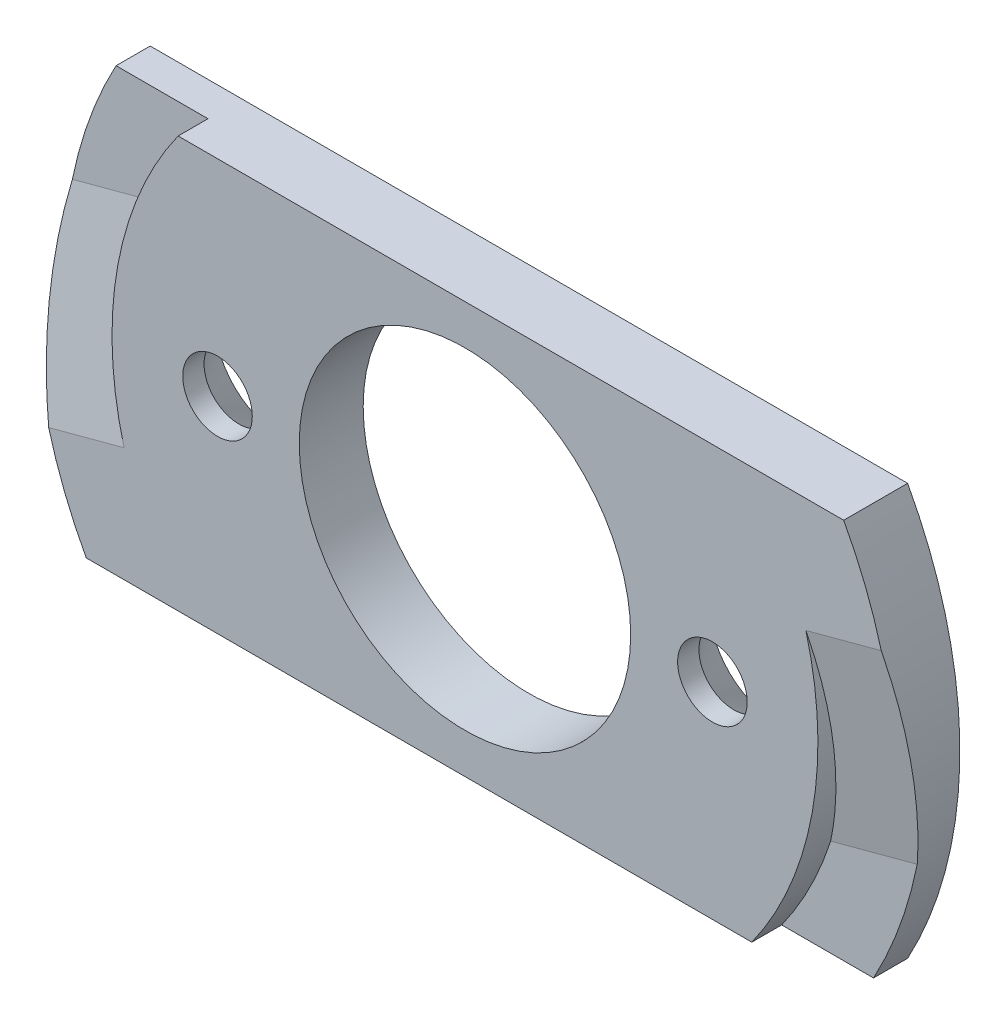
ISO-10303-21;
HEADER;
FILE_DESCRIPTION(('STEP AP214'),'2;1');
FILE_NAME('part.step','',(''),(''),'','','');
FILE_SCHEMA(('AUTOMOTIVE_DESIGN { 1 0 10303 214 1 1 1 1 }'));
ENDSEC;
DATA;
#1=APPLICATION_CONTEXT('core data for automotive mechanical design processes');
#2=APPLICATION_PROTOCOL_DEFINITION('international standard','automotive_design',2000,#1);
#3=PRODUCT_CONTEXT('',#1,'mechanical');
#4=PRODUCT('Part','Part','',(#3));
#5=PRODUCT_RELATED_PRODUCT_CATEGORY('part','',(#4));
#6=PRODUCT_DEFINITION_FORMATION('','',#4);
#7=PRODUCT_DEFINITION_CONTEXT('part definition',#1,'design');
#8=PRODUCT_DEFINITION('design','',#6,#7);
#9=PRODUCT_DEFINITION_SHAPE('','',#8);
#10=(LENGTH_UNIT() NAMED_UNIT(*) SI_UNIT(.MILLI.,.METRE.));
#11=(NAMED_UNIT(*) PLANE_ANGLE_UNIT() SI_UNIT($,.RADIAN.));
#12=(NAMED_UNIT(*) SI_UNIT($,.STERADIAN.) SOLID_ANGLE_UNIT());
#13=UNCERTAINTY_MEASURE_WITH_UNIT(LENGTH_MEASURE(1.E-05),#10,'distance_accuracy_value','');
#14=(GEOMETRIC_REPRESENTATION_CONTEXT(3) GLOBAL_UNCERTAINTY_ASSIGNED_CONTEXT((#13)) GLOBAL_UNIT_ASSIGNED_CONTEXT((#10,
#11,#12)) REPRESENTATION_CONTEXT('',''));
#15=CARTESIAN_POINT('',(0.,0.,0.));
#16=DIRECTION('',(0.,0.,1.));
#17=DIRECTION('',(1.,0.,0.));
#18=AXIS2_PLACEMENT_3D('',#15,#16,#17);
#19=CARTESIAN_POINT('',(0.,0.,3.));
#20=DIRECTION('',(0.,0.,-1.));
#21=DIRECTION('',(-1.,0.,0.));
#22=AXIS2_PLACEMENT_3D('',#19,#20,#21);
#23=CYLINDRICAL_SURFACE('',#22,16.56);
#24=CARTESIAN_POINT('',(0.,0.,1.6));
#25=DIRECTION('',(0.,0.,1.));
#26=DIRECTION('',(1.,0.,0.));
#27=AXIS2_PLACEMENT_3D('',#24,#25,#26);
#28=CIRCLE('',#27,16.56);
#29=CARTESIAN_POINT('',(13.4577524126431,-9.65,1.6));
#30=VERTEX_POINT('',#29);
#31=CARTESIAN_POINT('',(15.7565603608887,-5.09552799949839,1.6));
#32=VERTEX_POINT('',#31);
#33=EDGE_CURVE('E171',#30,#32,#28,.T.);
#34=ORIENTED_EDGE('',*,*,#33,.T.);
#35=CARTESIAN_POINT('',(0.,0.,3.00000000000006));
#36=DIRECTION('',(-0.0397823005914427,0.148469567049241,-0.988116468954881));
#37=DIRECTION('',(0.255743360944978,-0.95444721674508,-0.153707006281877));
#38=AXIS2_PLACEMENT_3D('',#35,#36,#37);
#39=ELLIPSE('',#38,16.759157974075,16.56);
#40=CARTESIAN_POINT('',(15.995731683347,4.28604338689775,3.));
#41=VERTEX_POINT('',#40);
#42=EDGE_CURVE('E61',#32,#41,#39,.F.);
#43=ORIENTED_EDGE('',*,*,#42,.T.);
#44=CARTESIAN_POINT('',(0.,0.,3.));
#45=DIRECTION('',(0.,0.,1.));
#46=DIRECTION('',(1.,0.,0.));
#47=AXIS2_PLACEMENT_3D('',#44,#45,#46);
#48=CIRCLE('',#47,16.56);
#49=CARTESIAN_POINT('',(13.4577524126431,-9.65,3.));
#50=VERTEX_POINT('',#49);
#51=EDGE_CURVE('E182',#50,#41,#48,.T.);
#52=ORIENTED_EDGE('',*,*,#51,.F.);
#53=DIRECTION('',(0.,0.,-1.));
#54=VECTOR('',#53,1.);
#55=CARTESIAN_POINT('',(13.4577524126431,-9.65,3.));
#56=LINE('',#55,#54);
#57=EDGE_CURVE('E222',#50,#30,#56,.T.);
#58=ORIENTED_EDGE('',*,*,#57,.T.);
#59=EDGE_LOOP('',(#34,#43,#52,#58));
#60=FACE_BOUND('',#59,.T.);
#61=ADVANCED_FACE('F51',(#60),#23,.T.);
#62=CARTESIAN_POINT('',(0.,0.,3.));
#63=DIRECTION('',(0.,0.,-1.));
#64=DIRECTION('',(-1.,0.,0.));
#65=AXIS2_PLACEMENT_3D('',#62,#63,#64);
#66=CYLINDRICAL_SURFACE('',#65,20.22);
#67=CARTESIAN_POINT('',(0.,0.,3.));
#68=DIRECTION('',(0.,0.,1.));
#69=DIRECTION('',(1.,0.,0.));
#70=AXIS2_PLACEMENT_3D('',#67,#68,#69);
#71=CIRCLE('',#70,20.22);
#72=CARTESIAN_POINT('',(19.531020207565,5.23332109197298,3.));
#73=VERTEX_POINT('',#72);
#74=CARTESIAN_POINT('',(17.768677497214,9.65,3.));
#75=VERTEX_POINT('',#74);
#76=EDGE_CURVE('E191',#73,#75,#71,.T.);
#77=ORIENTED_EDGE('',*,*,#76,.F.);
#78=CARTESIAN_POINT('',(0.,0.,3.00000000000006));
#79=DIRECTION('',(-0.0397823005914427,0.148469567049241,-0.988116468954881));
#80=DIRECTION('',(0.255743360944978,-0.95444721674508,-0.153707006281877));
#81=AXIS2_PLACEMENT_3D('',#78,#79,#80);
#82=ELLIPSE('',#81,20.463174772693,20.22);
#83=CARTESIAN_POINT('',(19.8189889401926,-4.00700354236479,1.6));
#84=VERTEX_POINT('',#83);
#85=EDGE_CURVE('E11',#73,#84,#82,.T.);
#86=ORIENTED_EDGE('',*,*,#85,.T.);
#87=CARTESIAN_POINT('',(0.,0.,1.6));
#88=DIRECTION('',(0.,0.,1.));
#89=DIRECTION('',(1.,0.,0.));
#90=AXIS2_PLACEMENT_3D('',#87,#88,#89);
#91=CIRCLE('',#90,20.22);
#92=CARTESIAN_POINT('',(17.768677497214,-9.65,1.6));
#93=VERTEX_POINT('',#92);
#94=EDGE_CURVE('E177',#93,#84,#91,.T.);
#95=ORIENTED_EDGE('',*,*,#94,.F.);
#96=DIRECTION('',(0.,0.,-1.));
#97=VECTOR('',#96,1.);
#98=CARTESIAN_POINT('',(17.768677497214,-9.65,1.6));
#99=LINE('',#98,#97);
#100=CARTESIAN_POINT('',(17.768677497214,-9.65,0.));
#101=VERTEX_POINT('',#100);
#102=EDGE_CURVE('E168',#93,#101,#99,.T.);
#103=ORIENTED_EDGE('',*,*,#102,.T.);
#104=CARTESIAN_POINT('',(0.,0.,0.));
#105=DIRECTION('',(0.,0.,1.));
#106=DIRECTION('',(1.,0.,0.));
#107=AXIS2_PLACEMENT_3D('',#104,#105,#106);
#108=CIRCLE('',#107,20.22);
#109=CARTESIAN_POINT('',(17.768677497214,9.65,0.));
#110=VERTEX_POINT('',#109);
#111=EDGE_CURVE('E150',#101,#110,#108,.T.);
#112=ORIENTED_EDGE('',*,*,#111,.T.);
#113=DIRECTION('',(0.,0.,-1.));
#114=VECTOR('',#113,1.);
#115=CARTESIAN_POINT('',(17.768677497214,9.65,3.));
#116=LINE('',#115,#114);
#117=EDGE_CURVE('E243',#75,#110,#116,.T.);
#118=ORIENTED_EDGE('',*,*,#117,.F.);
#119=EDGE_LOOP('',(#77,#86,#95,#103,#112,#118));
#120=FACE_BOUND('',#119,.T.);
#121=ADVANCED_FACE('F291',(#120),#66,.T.);
#122=CARTESIAN_POINT('',(0.,9.65,3.));
#123=DIRECTION('',(0.,1.,0.));
#124=DIRECTION('',(-1.,0.,0.));
#125=AXIS2_PLACEMENT_3D('',#122,#123,#124);
#126=PLANE('',#125);
#127=ORIENTED_EDGE('',*,*,#117,.T.);
#128=DIRECTION('',(1.,0.,0.));
#129=VECTOR('',#128,1.);
#130=CARTESIAN_POINT('',(0.,9.65,0.));
#131=LINE('',#130,#129);
#132=CARTESIAN_POINT('',(-17.768677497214,9.65,0.));
#133=VERTEX_POINT('',#132);
#134=EDGE_CURVE('E146',#133,#110,#131,.T.);
#135=ORIENTED_EDGE('',*,*,#134,.F.);
#136=DIRECTION('',(0.,0.,-1.));
#137=VECTOR('',#136,1.);
#138=CARTESIAN_POINT('',(-17.768677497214,9.65,1.6));
#139=LINE('',#138,#137);
#140=CARTESIAN_POINT('',(-17.768677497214,9.65,1.6));
#141=VERTEX_POINT('',#140);
#142=EDGE_CURVE('E140',#141,#133,#139,.T.);
#143=ORIENTED_EDGE('',*,*,#142,.F.);
#144=DIRECTION('',(1.,0.,0.));
#145=VECTOR('',#144,1.);
#146=CARTESIAN_POINT('',(0.,9.65,1.6));
#147=LINE('',#146,#145);
#148=CARTESIAN_POINT('',(-13.4577524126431,9.65,1.6));
#149=VERTEX_POINT('',#148);
#150=EDGE_CURVE('E144',#141,#149,#147,.T.);
#151=ORIENTED_EDGE('',*,*,#150,.T.);
#152=DIRECTION('',(0.,0.,-1.));
#153=VECTOR('',#152,1.);
#154=CARTESIAN_POINT('',(-13.4577524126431,9.65,3.));
#155=LINE('',#154,#153);
#156=CARTESIAN_POINT('',(-13.4577524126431,9.65,3.));
#157=VERTEX_POINT('',#156);
#158=EDGE_CURVE('E241',#157,#149,#155,.T.);
#159=ORIENTED_EDGE('',*,*,#158,.F.);
#160=DIRECTION('',(1.,0.,0.));
#161=VECTOR('',#160,1.);
#162=CARTESIAN_POINT('',(0.,9.65,3.));
#163=LINE('',#162,#161);
#164=EDGE_CURVE('E194',#157,#75,#163,.T.);
#165=ORIENTED_EDGE('',*,*,#164,.T.);
#166=EDGE_LOOP('',(#127,#135,#143,#151,#159,#165));
#167=FACE_BOUND('',#166,.T.);
#168=ADVANCED_FACE('F142',(#167),#126,.T.);
#169=CARTESIAN_POINT('',(0.,0.,3.));
#170=DIRECTION('',(0.,0.,-1.));
#171=DIRECTION('',(-1.,0.,0.));
#172=AXIS2_PLACEMENT_3D('',#169,#170,#171);
#173=CYLINDRICAL_SURFACE('',#172,16.56);
#174=CARTESIAN_POINT('',(0.,0.,1.6));
#175=DIRECTION('',(0.,0.,1.));
#176=DIRECTION('',(1.,0.,0.));
#177=AXIS2_PLACEMENT_3D('',#174,#175,#176);
#178=CIRCLE('',#177,16.56);
#179=CARTESIAN_POINT('',(-15.7565603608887,5.09552799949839,1.6));
#180=VERTEX_POINT('',#179);
#181=EDGE_CURVE('E165',#149,#180,#178,.T.);
#182=ORIENTED_EDGE('',*,*,#181,.T.);
#183=CARTESIAN_POINT('',(0.,0.,3.00000000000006));
#184=DIRECTION('',(-0.0397823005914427,0.148469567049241,0.988116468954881));
#185=DIRECTION('',(-0.255743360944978,0.95444721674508,-0.153707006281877));
#186=AXIS2_PLACEMENT_3D('',#183,#184,#185);
#187=ELLIPSE('',#186,16.759157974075,16.56);
#188=CARTESIAN_POINT('',(-15.995731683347,-4.28604338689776,3.));
#189=VERTEX_POINT('',#188);
#190=EDGE_CURVE('E265',#180,#189,#187,.T.);
#191=ORIENTED_EDGE('',*,*,#190,.T.);
#192=CARTESIAN_POINT('',(0.,0.,3.));
#193=DIRECTION('',(0.,0.,1.));
#194=DIRECTION('',(1.,0.,0.));
#195=AXIS2_PLACEMENT_3D('',#192,#193,#194);
#196=CIRCLE('',#195,16.56);
#197=EDGE_CURVE('E198',#157,#189,#196,.T.);
#198=ORIENTED_EDGE('',*,*,#197,.F.);
#199=ORIENTED_EDGE('',*,*,#158,.T.);
#200=EDGE_LOOP('',(#182,#191,#198,#199));
#201=FACE_BOUND('',#200,.T.);
#202=ADVANCED_FACE('F347',(#201),#173,.T.);
#203=CARTESIAN_POINT('',(0.,0.,3.));
#204=DIRECTION('',(0.,0.,-1.));
#205=DIRECTION('',(-1.,0.,0.));
#206=AXIS2_PLACEMENT_3D('',#203,#204,#205);
#207=CYLINDRICAL_SURFACE('',#206,20.22);
#208=CARTESIAN_POINT('',(0.,0.,3.));
#209=DIRECTION('',(0.,0.,1.));
#210=DIRECTION('',(1.,0.,0.));
#211=AXIS2_PLACEMENT_3D('',#208,#209,#210);
#212=CIRCLE('',#211,20.22);
#213=CARTESIAN_POINT('',(-19.531020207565,-5.23332109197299,3.));
#214=VERTEX_POINT('',#213);
#215=CARTESIAN_POINT('',(-17.768677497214,-9.65,3.));
#216=VERTEX_POINT('',#215);
#217=EDGE_CURVE('E205',#214,#216,#212,.T.);
#218=ORIENTED_EDGE('',*,*,#217,.F.);
#219=CARTESIAN_POINT('',(0.,0.,3.00000000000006));
#220=DIRECTION('',(-0.0397823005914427,0.148469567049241,0.988116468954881));
#221=DIRECTION('',(-0.255743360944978,0.95444721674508,-0.153707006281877));
#222=AXIS2_PLACEMENT_3D('',#219,#220,#221);
#223=ELLIPSE('',#222,20.463174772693,20.22);
#224=CARTESIAN_POINT('',(-19.8189889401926,4.00700354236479,1.6));
#225=VERTEX_POINT('',#224);
#226=EDGE_CURVE('E156',#214,#225,#223,.F.);
#227=ORIENTED_EDGE('',*,*,#226,.T.);
#228=CARTESIAN_POINT('',(0.,0.,1.6));
#229=DIRECTION('',(0.,0.,1.));
#230=DIRECTION('',(1.,0.,0.));
#231=AXIS2_PLACEMENT_3D('',#228,#229,#230);
#232=CIRCLE('',#231,20.22);
#233=EDGE_CURVE('E151',#141,#225,#232,.T.);
#234=ORIENTED_EDGE('',*,*,#233,.F.);
#235=ORIENTED_EDGE('',*,*,#142,.T.);
#236=CARTESIAN_POINT('',(0.,0.,0.));
#237=DIRECTION('',(0.,0.,1.));
#238=DIRECTION('',(1.,0.,0.));
#239=AXIS2_PLACEMENT_3D('',#236,#237,#238);
#240=CIRCLE('',#239,20.22);
#241=CARTESIAN_POINT('',(-17.768677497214,-9.65,0.));
#242=VERTEX_POINT('',#241);
#243=EDGE_CURVE('E228',#133,#242,#240,.T.);
#244=ORIENTED_EDGE('',*,*,#243,.T.);
#245=DIRECTION('',(0.,0.,-1.));
#246=VECTOR('',#245,1.);
#247=CARTESIAN_POINT('',(-17.768677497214,-9.65,3.));
#248=LINE('',#247,#246);
#249=EDGE_CURVE('E239',#216,#242,#248,.T.);
#250=ORIENTED_EDGE('',*,*,#249,.F.);
#251=EDGE_LOOP('',(#218,#227,#234,#235,#244,#250));
#252=FACE_BOUND('',#251,.T.);
#253=ADVANCED_FACE('F154',(#252),#207,.T.);
#254=CARTESIAN_POINT('',(0.,0.,3.));
#255=DIRECTION('',(0.,0.,-1.));
#256=DIRECTION('',(-1.,0.,0.));
#257=AXIS2_PLACEMENT_3D('',#254,#255,#256);
#258=CYLINDRICAL_SURFACE('',#257,7.775);
#259=CARTESIAN_POINT('',(0.,0.,3.));
#260=DIRECTION('',(0.,0.,1.));
#261=DIRECTION('',(1.,0.,0.));
#262=AXIS2_PLACEMENT_3D('',#259,#260,#261);
#263=CIRCLE('',#262,7.775);
#264=CARTESIAN_POINT('',(7.775,0.,3.));
#265=VERTEX_POINT('',#264);
#266=EDGE_CURVE('E214',#265,#265,#263,.T.);
#267=ORIENTED_EDGE('',*,*,#266,.T.);
#268=EDGE_LOOP('',(#267));
#269=FACE_BOUND('',#268,.T.);
#270=CARTESIAN_POINT('',(0.,0.,0.));
#271=DIRECTION('',(0.,0.,1.));
#272=DIRECTION('',(1.,0.,0.));
#273=AXIS2_PLACEMENT_3D('',#270,#271,#272);
#274=CIRCLE('',#273,7.775);
#275=CARTESIAN_POINT('',(7.775,0.,0.));
#276=VERTEX_POINT('',#275);
#277=EDGE_CURVE('E187',#276,#276,#274,.T.);
#278=ORIENTED_EDGE('',*,*,#277,.F.);
#279=EDGE_LOOP('',(#278));
#280=FACE_BOUND('',#279,.T.);
#281=ADVANCED_FACE('F334',(#269,#280),#258,.F.);
#282=CARTESIAN_POINT('',(11.61,0.,3.));
#283=DIRECTION('',(0.,0.,-1.));
#284=DIRECTION('',(-1.,0.,0.));
#285=AXIS2_PLACEMENT_3D('',#282,#283,#284);
#286=CYLINDRICAL_SURFACE('',#285,1.6319499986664);
#287=CARTESIAN_POINT('',(11.61,0.,2.00000000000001));
#288=DIRECTION('',(0.,0.,1.));
#289=DIRECTION('',(1.,0.,0.));
#290=AXIS2_PLACEMENT_3D('',#287,#288,#289);
#291=CIRCLE('',#290,1.6319499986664);
#292=CARTESIAN_POINT('',(13.2419499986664,0.,2.00000000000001));
#293=VERTEX_POINT('',#292);
#294=EDGE_CURVE('E254',#293,#293,#291,.F.);
#295=ORIENTED_EDGE('',*,*,#294,.T.);
#296=EDGE_LOOP('',(#295));
#297=FACE_BOUND('',#296,.T.);
#298=CARTESIAN_POINT('',(11.61,0.,3.));
#299=DIRECTION('',(0.,0.,1.));
#300=DIRECTION('',(1.,0.,0.));
#301=AXIS2_PLACEMENT_3D('',#298,#299,#300);
#302=CIRCLE('',#301,1.6319499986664);
#303=CARTESIAN_POINT('',(13.2419499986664,0.,3.));
#304=VERTEX_POINT('',#303);
#305=EDGE_CURVE('E210',#304,#304,#302,.T.);
#306=ORIENTED_EDGE('',*,*,#305,.T.);
#307=EDGE_LOOP('',(#306));
#308=FACE_BOUND('',#307,.T.);
#309=ADVANCED_FACE('F336',(#297,#308),#286,.F.);
#310=CARTESIAN_POINT('',(0.,-9.65,3.));
#311=DIRECTION('',(0.,1.,0.));
#312=DIRECTION('',(-1.,0.,0.));
#313=AXIS2_PLACEMENT_3D('',#310,#311,#312);
#314=PLANE('',#313);
#315=DIRECTION('',(1.,0.,0.));
#316=VECTOR('',#315,1.);
#317=CARTESIAN_POINT('',(0.,-9.65,0.));
#318=LINE('',#317,#316);
#319=EDGE_CURVE('E231',#242,#101,#318,.T.);
#320=ORIENTED_EDGE('',*,*,#319,.T.);
#321=ORIENTED_EDGE('',*,*,#102,.F.);
#322=DIRECTION('',(1.,0.,0.));
#323=VECTOR('',#322,1.);
#324=CARTESIAN_POINT('',(0.,-9.65,1.6));
#325=LINE('',#324,#323);
#326=EDGE_CURVE('E174',#30,#93,#325,.T.);
#327=ORIENTED_EDGE('',*,*,#326,.F.);
#328=ORIENTED_EDGE('',*,*,#57,.F.);
#329=DIRECTION('',(1.,0.,0.));
#330=VECTOR('',#329,1.);
#331=CARTESIAN_POINT('',(0.,-9.65,3.));
#332=LINE('',#331,#330);
#333=EDGE_CURVE('E207',#216,#50,#332,.T.);
#334=ORIENTED_EDGE('',*,*,#333,.F.);
#335=ORIENTED_EDGE('',*,*,#249,.T.);
#336=EDGE_LOOP('',(#320,#321,#327,#328,#334,#335));
#337=FACE_BOUND('',#336,.T.);
#338=ADVANCED_FACE('F343',(#337),#314,.F.);
#339=CARTESIAN_POINT('',(-11.61,0.,3.));
#340=DIRECTION('',(0.,0.,-1.));
#341=DIRECTION('',(-1.,0.,0.));
#342=AXIS2_PLACEMENT_3D('',#339,#340,#341);
#343=CYLINDRICAL_SURFACE('',#342,1.6319499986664);
#344=CARTESIAN_POINT('',(-11.61,0.,2.00000000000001));
#345=DIRECTION('',(0.,0.,1.));
#346=DIRECTION('',(1.,0.,0.));
#347=AXIS2_PLACEMENT_3D('',#344,#345,#346);
#348=CIRCLE('',#347,1.6319499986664);
#349=CARTESIAN_POINT('',(-9.9780500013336,0.,2.00000000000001));
#350=VERTEX_POINT('',#349);
#351=EDGE_CURVE('E258',#350,#350,#348,.F.);
#352=ORIENTED_EDGE('',*,*,#351,.T.);
#353=EDGE_LOOP('',(#352));
#354=FACE_BOUND('',#353,.T.);
#355=CARTESIAN_POINT('',(-11.61,0.,3.));
#356=DIRECTION('',(0.,0.,1.));
#357=DIRECTION('',(1.,0.,0.));
#358=AXIS2_PLACEMENT_3D('',#355,#356,#357);
#359=CIRCLE('',#358,1.6319499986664);
#360=CARTESIAN_POINT('',(-9.9780500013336,0.,3.));
#361=VERTEX_POINT('',#360);
#362=EDGE_CURVE('E218',#361,#361,#359,.T.);
#363=ORIENTED_EDGE('',*,*,#362,.T.);
#364=EDGE_LOOP('',(#363));
#365=FACE_BOUND('',#364,.T.);
#366=ADVANCED_FACE('F350',(#354,#365),#343,.F.);
#367=CARTESIAN_POINT('',(0.,0.,3.));
#368=DIRECTION('',(0.,0.,1.));
#369=DIRECTION('',(1.,0.,0.));
#370=AXIS2_PLACEMENT_3D('',#367,#368,#369);
#371=PLANE('',#370);
#372=ORIENTED_EDGE('',*,*,#51,.T.);
#373=DIRECTION('',(0.965925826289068,0.258819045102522,0.));
#374=VECTOR('',#373,1.);
#375=CARTESIAN_POINT('',(0.,0.,3.));
#376=LINE('',#375,#374);
#377=EDGE_CURVE('E186',#41,#73,#376,.T.);
#378=ORIENTED_EDGE('',*,*,#377,.T.);
#379=ORIENTED_EDGE('',*,*,#76,.T.);
#380=ORIENTED_EDGE('',*,*,#164,.F.);
#381=ORIENTED_EDGE('',*,*,#197,.T.);
#382=DIRECTION('',(0.965925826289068,0.258819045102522,0.));
#383=VECTOR('',#382,1.);
#384=CARTESIAN_POINT('',(0.,0.,3.));
#385=LINE('',#384,#383);
#386=EDGE_CURVE('E202',#214,#189,#385,.T.);
#387=ORIENTED_EDGE('',*,*,#386,.F.);
#388=ORIENTED_EDGE('',*,*,#217,.T.);
#389=ORIENTED_EDGE('',*,*,#333,.T.);
#390=EDGE_LOOP('',(#372,#378,#379,#380,#381,#387,#388,#389));
#391=FACE_BOUND('',#390,.T.);
#392=ORIENTED_EDGE('',*,*,#305,.F.);
#393=EDGE_LOOP('',(#392));
#394=FACE_BOUND('',#393,.T.);
#395=ORIENTED_EDGE('',*,*,#266,.F.);
#396=EDGE_LOOP('',(#395));
#397=FACE_BOUND('',#396,.T.);
#398=ORIENTED_EDGE('',*,*,#362,.F.);
#399=EDGE_LOOP('',(#398));
#400=FACE_BOUND('',#399,.T.);
#401=ADVANCED_FACE('F278',(#391,#394,#397,#400),#371,.T.);
#402=CARTESIAN_POINT('',(0.,0.,0.));
#403=DIRECTION('',(0.,0.,1.));
#404=DIRECTION('',(1.,0.,0.));
#405=AXIS2_PLACEMENT_3D('',#402,#403,#404);
#406=PLANE('',#405);
#407=CARTESIAN_POINT('',(11.61,0.,0.));
#408=DIRECTION('',(0.,0.,1.));
#409=DIRECTION('',(1.,0.,0.));
#410=AXIS2_PLACEMENT_3D('',#407,#408,#409);
#411=CIRCLE('',#410,3.13194999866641);
#412=CARTESIAN_POINT('',(14.7419499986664,0.,0.));
#413=VERTEX_POINT('',#412);
#414=EDGE_CURVE('E250',#413,#413,#411,.T.);
#415=ORIENTED_EDGE('',*,*,#414,.T.);
#416=EDGE_LOOP('',(#415));
#417=FACE_BOUND('',#416,.T.);
#418=CARTESIAN_POINT('',(-11.61,0.,0.));
#419=DIRECTION('',(0.,0.,1.));
#420=DIRECTION('',(1.,0.,0.));
#421=AXIS2_PLACEMENT_3D('',#418,#419,#420);
#422=CIRCLE('',#421,3.13194999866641);
#423=CARTESIAN_POINT('',(-8.47805000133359,0.,0.));
#424=VERTEX_POINT('',#423);
#425=EDGE_CURVE('E246',#424,#424,#422,.T.);
#426=ORIENTED_EDGE('',*,*,#425,.T.);
#427=EDGE_LOOP('',(#426));
#428=FACE_BOUND('',#427,.T.);
#429=ORIENTED_EDGE('',*,*,#111,.F.);
#430=ORIENTED_EDGE('',*,*,#319,.F.);
#431=ORIENTED_EDGE('',*,*,#243,.F.);
#432=ORIENTED_EDGE('',*,*,#134,.T.);
#433=EDGE_LOOP('',(#429,#430,#431,#432));
#434=FACE_BOUND('',#433,.T.);
#435=ORIENTED_EDGE('',*,*,#277,.T.);
#436=EDGE_LOOP('',(#435));
#437=FACE_BOUND('',#436,.T.);
#438=ADVANCED_FACE('F323',(#417,#428,#434,#437),#406,.F.);
#439=CARTESIAN_POINT('',(0.,0.,1.6));
#440=DIRECTION('',(0.,0.,1.));
#441=DIRECTION('',(1.,0.,0.));
#442=AXIS2_PLACEMENT_3D('',#439,#440,#441);
#443=PLANE('',#442);
#444=ORIENTED_EDGE('',*,*,#94,.T.);
#445=DIRECTION('',(-0.965925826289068,-0.258819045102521,0.));
#446=VECTOR('',#445,1.);
#447=CARTESIAN_POINT('',(2.3293714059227,-8.69333243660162,1.6));
#448=LINE('',#447,#446);
#449=EDGE_CURVE('E77',#84,#32,#448,.T.);
#450=ORIENTED_EDGE('',*,*,#449,.T.);
#451=ORIENTED_EDGE('',*,*,#33,.F.);
#452=ORIENTED_EDGE('',*,*,#326,.T.);
#453=EDGE_LOOP('',(#444,#450,#451,#452));
#454=FACE_BOUND('',#453,.T.);
#455=ADVANCED_FACE('F326',(#454),#443,.T.);
#456=CARTESIAN_POINT('',(0.,0.,1.6));
#457=DIRECTION('',(0.,0.,1.));
#458=DIRECTION('',(1.,0.,0.));
#459=AXIS2_PLACEMENT_3D('',#456,#457,#458);
#460=PLANE('',#459);
#461=ORIENTED_EDGE('',*,*,#233,.T.);
#462=DIRECTION('',(0.965925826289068,0.258819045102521,0.));
#463=VECTOR('',#462,1.);
#464=CARTESIAN_POINT('',(-18.3251030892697,4.40728904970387,1.6));
#465=LINE('',#464,#463);
#466=EDGE_CURVE('E262',#225,#180,#465,.T.);
#467=ORIENTED_EDGE('',*,*,#466,.T.);
#468=ORIENTED_EDGE('',*,*,#181,.F.);
#469=ORIENTED_EDGE('',*,*,#150,.F.);
#470=EDGE_LOOP('',(#461,#467,#468,#469));
#471=FACE_BOUND('',#470,.T.);
#472=ADVANCED_FACE('F163',(#471),#460,.T.);
#473=CARTESIAN_POINT('',(11.61,0.,0.));
#474=DIRECTION('',(0.,0.,-1.));
#475=DIRECTION('',(-1.,0.,0.));
#476=AXIS2_PLACEMENT_3D('',#473,#474,#475);
#477=CONICAL_SURFACE('',#476,3.13194999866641,0.643501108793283);
#478=ORIENTED_EDGE('',*,*,#294,.F.);
#479=EDGE_LOOP('',(#478));
#480=FACE_BOUND('',#479,.T.);
#481=ORIENTED_EDGE('',*,*,#414,.F.);
#482=EDGE_LOOP('',(#481));
#483=FACE_BOUND('',#482,.T.);
#484=ADVANCED_FACE('F300',(#480,#483),#477,.F.);
#485=CARTESIAN_POINT('',(-11.61,0.,0.));
#486=DIRECTION('',(0.,0.,-1.));
#487=DIRECTION('',(-1.,0.,0.));
#488=AXIS2_PLACEMENT_3D('',#485,#486,#487);
#489=CONICAL_SURFACE('',#488,3.13194999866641,0.643501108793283);
#490=ORIENTED_EDGE('',*,*,#351,.F.);
#491=EDGE_LOOP('',(#490));
#492=FACE_BOUND('',#491,.T.);
#493=ORIENTED_EDGE('',*,*,#425,.F.);
#494=EDGE_LOOP('',(#493));
#495=FACE_BOUND('',#494,.T.);
#496=ADVANCED_FACE('F288',(#492,#495),#489,.F.);
#497=CARTESIAN_POINT('',(-2.3293714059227,8.69333243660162,1.6));
#498=DIRECTION('',(-0.0397823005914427,0.148469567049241,0.988116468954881));
#499=DIRECTION('',(-0.965925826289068,-0.258819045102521,0.));
#500=AXIS2_PLACEMENT_3D('',#497,#498,#499);
#501=PLANE('',#500);
#502=ORIENTED_EDGE('',*,*,#226,.F.);
#503=ORIENTED_EDGE('',*,*,#386,.T.);
#504=ORIENTED_EDGE('',*,*,#190,.F.);
#505=ORIENTED_EDGE('',*,*,#466,.F.);
#506=EDGE_LOOP('',(#502,#503,#504,#505));
#507=FACE_BOUND('',#506,.T.);
#508=ADVANCED_FACE('F283',(#507),#501,.T.);
#509=CARTESIAN_POINT('',(0.,0.,3.00000000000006));
#510=DIRECTION('',(-0.0397823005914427,0.148469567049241,-0.988116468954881));
#511=DIRECTION('',(0.965925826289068,0.258819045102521,0.));
#512=AXIS2_PLACEMENT_3D('',#509,#510,#511);
#513=PLANE('',#512);
#514=ORIENTED_EDGE('',*,*,#42,.F.);
#515=ORIENTED_EDGE('',*,*,#449,.F.);
#516=ORIENTED_EDGE('',*,*,#85,.F.);
#517=ORIENTED_EDGE('',*,*,#377,.F.);
#518=EDGE_LOOP('',(#514,#515,#516,#517));
#519=FACE_BOUND('',#518,.T.);
#520=ADVANCED_FACE('F54',(#519),#513,.F.);
#521=CLOSED_SHELL('',(#61,#121,#168,#202,#253,#281,#309,#338,#366,#401,#438,#455,#472,#484,#496,
#508,#520));
#522=MANIFOLD_SOLID_BREP('B2',#521);
#523=ADVANCED_BREP_SHAPE_REPRESENTATION('',(#18,#522),#14);
#524=SHAPE_DEFINITION_REPRESENTATION(#9,#523);
ENDSEC;
END-ISO-10303-21;
